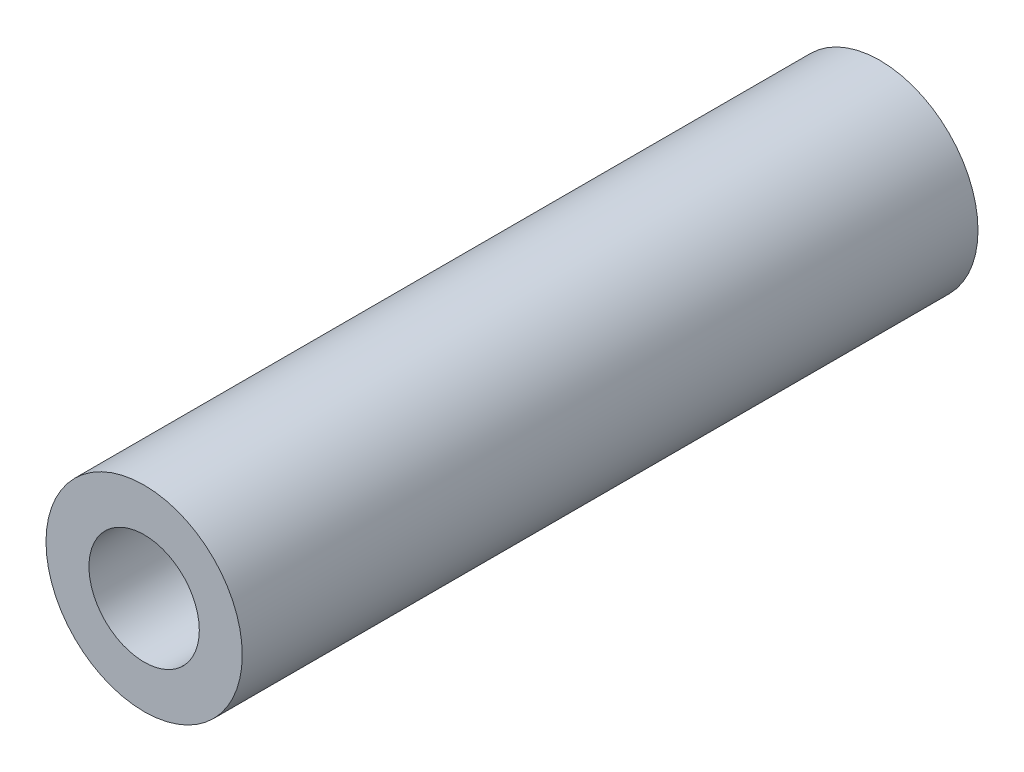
from build123d import *

# Parameters (mm, degrees)
SKETCH1_R          = 6.77545
SKETCH1_R_2        = 3.81
BASE_EXTRUDE_DEPTH = 50.8


with BuildPart() as part:
    # Sketch1 → Base-Extrude (new body)
    with BuildSketch(Plane.XY):
        Circle(SKETCH1_R)
        Circle(SKETCH1_R_2, mode=Mode.SUBTRACT)
    extrude(amount=BASE_EXTRUDE_DEPTH)


solid = part.part
